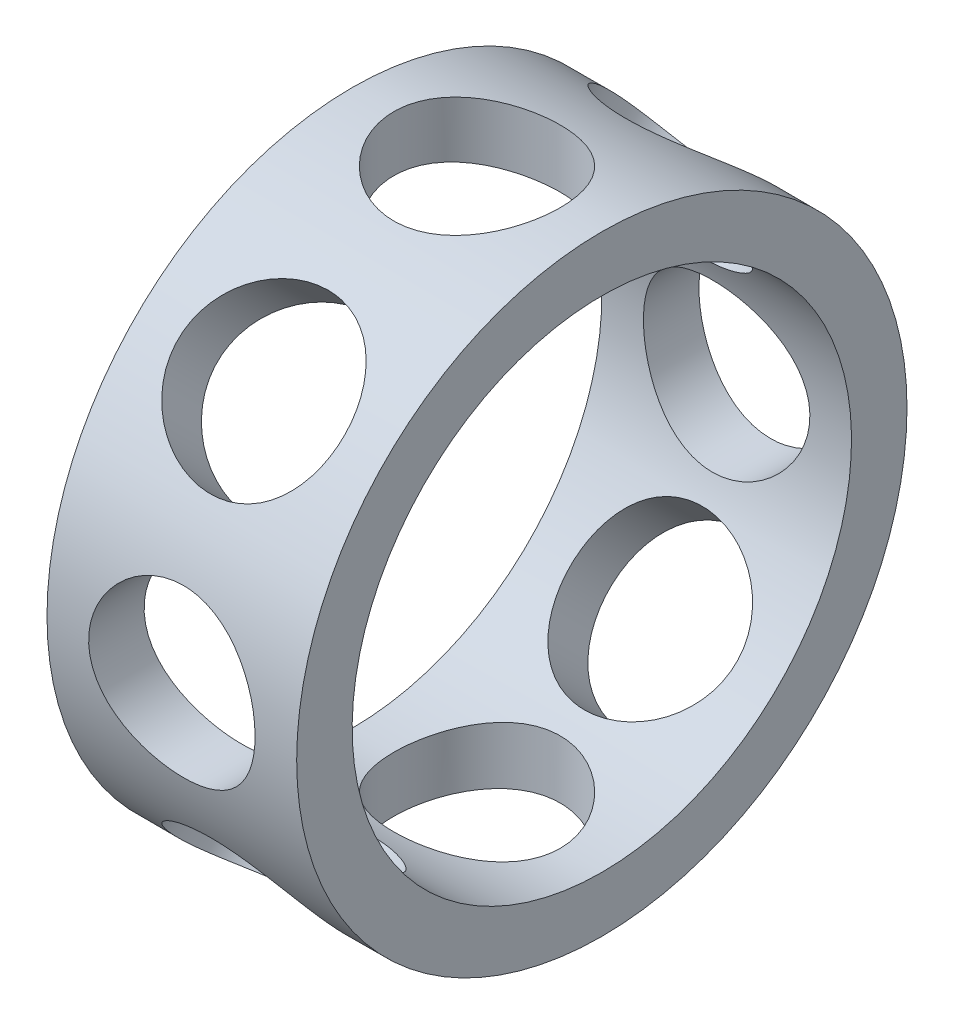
from build123d import *

# Parameters (mm, degrees)
SKETCH1_W               = 4.5
SKETCH1_H               = 1
CUT_EXTRUDE2_REACH      = 10.097
CUT_EXTRUDE2_END_RADIUS = 5.5
SKETCH2_R               = 1.5
CIRPATTERN1_COUNT       = 8


with BuildPart() as part:
    # Sketch1 → Revolve1 (revolve)
    with BuildSketch(Plane.XY, mode=Mode.PRIVATE) as revolve1_sk:
        with Locations((0, 5)):
            Rectangle(SKETCH1_W, SKETCH1_H)
    revolve(revolve1_sk.sketch.rotate(Axis((-2.25, 0, 0), (1, 0, 0)), 180), axis=Axis((-2.25, 0, 0), (1, 0, 0)))

    # Cut-Extrude2: up to this cylinder (the profile starts inside it)
    cut_extrude2_end = Plane(origin=(0, 0, 0), z_dir=(-1, 0, 0)) * Cylinder(CUT_EXTRUDE2_END_RADIUS, 32.194, mode=Mode.PRIVATE)
    # Sketch2 → Cut-Extrude2 (cut, up to the surface)
    with BuildSketch(Plane(origin=(0, 0, 0), x_dir=(1, 0, 0), z_dir=(0, 1, 0)), mode=Mode.PRIVATE) as cut_extrude2_sk1:
        with Locations(Location((0, 0, 0), (0, 0, 270))):
            Circle(SKETCH2_R)
    cut_extrude2_tool1 = extrude(cut_extrude2_sk1.sketch, amount=-CUT_EXTRUDE2_REACH, mode=Mode.PRIVATE) & cut_extrude2_end
    cut_extrude2 = cut_extrude2_tool1.solids().sort_by_distance((0, 0, 0))[0]
    add(cut_extrude2, mode=Mode.SUBTRACT)

    # CirPattern1: Cut-Extrude2 ×8 about axis
    cirpattern1_axis = Axis((-2.25, 0, 0), (-1, 0, 0))
    for i in range(1, CIRPATTERN1_COUNT):
        add(cut_extrude2.rotate(cirpattern1_axis, i * 360 / CIRPATTERN1_COUNT), mode=Mode.SUBTRACT)


solid = part.part
